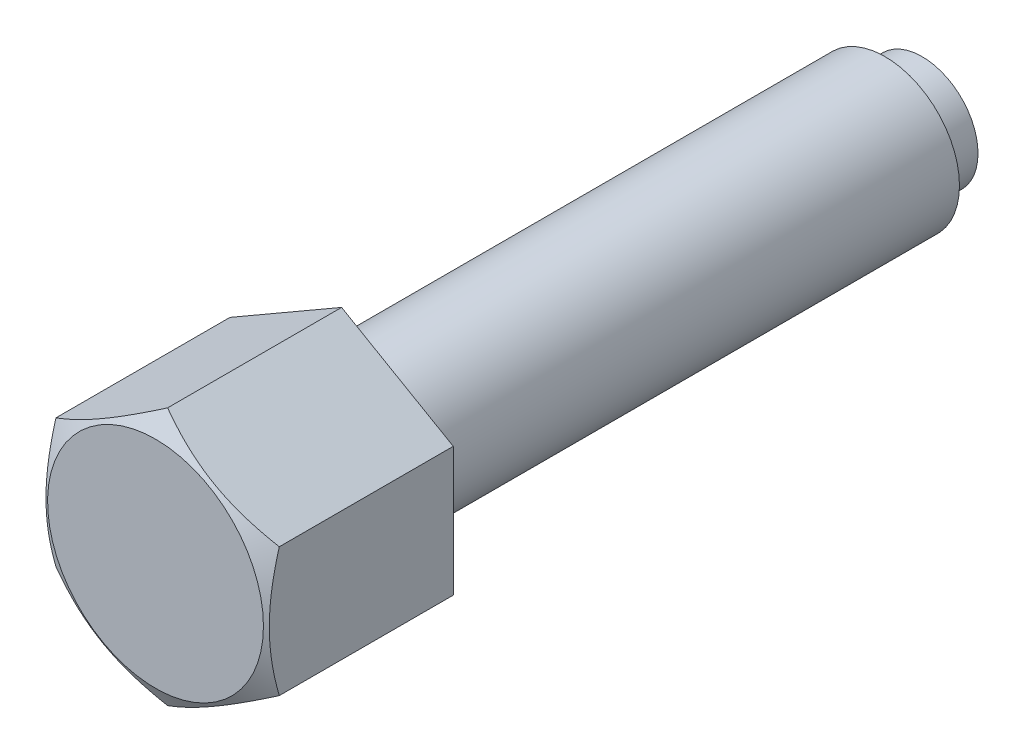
ISO-10303-21;
HEADER;
FILE_DESCRIPTION(('STEP AP214'),'2;1');
FILE_NAME('part.step','',(''),(''),'','','');
FILE_SCHEMA(('AUTOMOTIVE_DESIGN { 1 0 10303 214 1 1 1 1 }'));
ENDSEC;
DATA;
#1=APPLICATION_CONTEXT('core data for automotive mechanical design processes');
#2=APPLICATION_PROTOCOL_DEFINITION('international standard','automotive_design',2000,#1);
#3=PRODUCT_CONTEXT('',#1,'mechanical');
#4=PRODUCT('Part','Part','',(#3));
#5=PRODUCT_RELATED_PRODUCT_CATEGORY('part','',(#4));
#6=PRODUCT_DEFINITION_FORMATION('','',#4);
#7=PRODUCT_DEFINITION_CONTEXT('part definition',#1,'design');
#8=PRODUCT_DEFINITION('design','',#6,#7);
#9=PRODUCT_DEFINITION_SHAPE('','',#8);
#10=(LENGTH_UNIT() NAMED_UNIT(*) SI_UNIT(.MILLI.,.METRE.));
#11=(NAMED_UNIT(*) PLANE_ANGLE_UNIT() SI_UNIT($,.RADIAN.));
#12=(NAMED_UNIT(*) SI_UNIT($,.STERADIAN.) SOLID_ANGLE_UNIT());
#13=UNCERTAINTY_MEASURE_WITH_UNIT(LENGTH_MEASURE(1.E-05),#10,'distance_accuracy_value','');
#14=(GEOMETRIC_REPRESENTATION_CONTEXT(3) GLOBAL_UNCERTAINTY_ASSIGNED_CONTEXT((#13)) GLOBAL_UNIT_ASSIGNED_CONTEXT((#10,
#11,#12)) REPRESENTATION_CONTEXT('',''));
#15=CARTESIAN_POINT('',(0.,0.,0.));
#16=DIRECTION('',(0.,0.,1.));
#17=DIRECTION('',(1.,0.,0.));
#18=AXIS2_PLACEMENT_3D('',#15,#16,#17);
#19=CARTESIAN_POINT('',(0.,17.3205080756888,75.));
#20=DIRECTION('',(-0.5,-0.86602540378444,0.));
#21=DIRECTION('',(0.86602540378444,-0.5,0.));
#22=AXIS2_PLACEMENT_3D('',#19,#20,#21);
#23=PLANE('',#22);
#24=CARTESIAN_POINT('',(15.0002,8.66013856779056,103.371512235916));
#25=CARTESIAN_POINT('',(14.6705058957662,8.85048754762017,103.481403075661));
#26=CARTESIAN_POINT('',(14.3395258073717,9.04157899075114,103.586307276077));
#27=CARTESIAN_POINT('',(13.674911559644,9.425294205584,103.784756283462));
#28=CARTESIAN_POINT('',(13.3412765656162,9.61791845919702,103.878297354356));
#29=CARTESIAN_POINT('',(12.6707077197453,10.0050715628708,104.052762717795));
#30=CARTESIAN_POINT('',(12.333767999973,10.199603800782,104.133657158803));
#31=CARTESIAN_POINT('',(11.6575472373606,10.5900200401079,104.281092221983));
#32=CARTESIAN_POINT('',(11.3182663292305,10.7859039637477,104.347633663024));
#33=CARTESIAN_POINT('',(10.6460568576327,11.1740042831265,104.463532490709));
#34=CARTESIAN_POINT('',(10.3131781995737,11.3661918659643,104.513273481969));
#35=CARTESIAN_POINT('',(9.64589556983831,11.7514476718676,104.596678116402));
#36=CARTESIAN_POINT('',(9.31149156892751,11.9445159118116,104.630341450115));
#37=CARTESIAN_POINT('',(8.64212181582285,12.3309767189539,104.680740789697));
#38=CARTESIAN_POINT('',(8.30715720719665,12.5243686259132,104.697496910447));
#39=CARTESIAN_POINT('',(7.636918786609,12.9113309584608,104.713721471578));
#40=CARTESIAN_POINT('',(7.30164498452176,13.1049013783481,104.713190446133));
#41=CARTESIAN_POINT('',(6.67485311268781,13.4667798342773,104.696048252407));
#42=CARTESIAN_POINT('',(6.38329037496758,13.6351136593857,104.681528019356));
#43=CARTESIAN_POINT('',(5.80083556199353,13.9713941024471,104.639687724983));
#44=CARTESIAN_POINT('',(5.50994353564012,14.1393406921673,104.612366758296));
#45=CARTESIAN_POINT('',(4.92898814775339,14.4747554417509,104.545401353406));
#46=CARTESIAN_POINT('',(4.63892567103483,14.6422230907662,104.505746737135));
#47=CARTESIAN_POINT('',(4.06016058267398,14.9763732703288,104.414809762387));
#48=CARTESIAN_POINT('',(3.77145806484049,15.1430557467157,104.363526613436));
#49=CARTESIAN_POINT('',(2.89508556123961,15.6490296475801,104.190938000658));
#50=CARTESIAN_POINT('',(2.30995340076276,15.9868558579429,104.052423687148));
#51=CARTESIAN_POINT('',(1.14841408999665,16.657470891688,103.73805289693));
#52=CARTESIAN_POINT('',(0.571992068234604,16.9902683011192,103.562270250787));
#53=CARTESIAN_POINT('',(-0.000199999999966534,17.3206235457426,103.371512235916));
#54=B_SPLINE_CURVE_WITH_KNOTS('',3,(#24,#25,#26,#27,#28,#29,#30,#31,#32,#33,#34,#35,#36,#37,#38,
#39,#40,#41,#42,#43,#44,#45,#46,#47,#48,#49,#50,#51,#52,#53),.UNSPECIFIED.,.F.,.F.,(4,2,2,2,2,2,
2,2,2,2,2,2,2,2,4),(0.,1.18875411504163,2.37789802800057,3.56980778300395,4.76164951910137,
5.92407379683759,7.08652044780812,8.24758247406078,9.40860862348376,10.4193068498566,
11.4300765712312,12.4416826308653,13.4533574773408,15.5211962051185,17.5849760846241),.UNSPECIFIED.);
#55=CARTESIAN_POINT('',(15.,8.66025403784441,103.37157890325));
#56=VERTEX_POINT('',#55);
#57=CARTESIAN_POINT('',(0.,17.3205080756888,103.37157890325));
#58=VERTEX_POINT('',#57);
#59=EDGE_CURVE('E30',#56,#58,#54,.T.);
#60=ORIENTED_EDGE('',*,*,#59,.F.);
#61=DIRECTION('',(0.,0.,1.));
#62=VECTOR('',#61,1.);
#63=CARTESIAN_POINT('',(15.,8.66025403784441,75.));
#64=LINE('',#63,#62);
#65=CARTESIAN_POINT('',(15.,8.66025403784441,80.));
#66=VERTEX_POINT('',#65);
#67=EDGE_CURVE('E97',#66,#56,#64,.T.);
#68=ORIENTED_EDGE('',*,*,#67,.F.);
#69=DIRECTION('',(0.86602540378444,-0.5,0.));
#70=VECTOR('',#69,1.);
#71=CARTESIAN_POINT('',(15.,8.66025403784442,80.));
#72=LINE('',#71,#70);
#73=CARTESIAN_POINT('',(0.,17.3205080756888,80.));
#74=VERTEX_POINT('',#73);
#75=EDGE_CURVE('E111',#74,#66,#72,.T.);
#76=ORIENTED_EDGE('',*,*,#75,.F.);
#77=DIRECTION('',(0.,0.,1.));
#78=VECTOR('',#77,1.);
#79=CARTESIAN_POINT('',(0.,17.3205080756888,75.));
#80=LINE('',#79,#78);
#81=EDGE_CURVE('E37',#74,#58,#80,.T.);
#82=ORIENTED_EDGE('',*,*,#81,.T.);
#83=EDGE_LOOP('',(#60,#68,#76,#82));
#84=FACE_BOUND('',#83,.T.);
#85=ADVANCED_FACE('F15',(#84),#23,.F.);
#86=CARTESIAN_POINT('',(15.,8.66025403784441,75.));
#87=DIRECTION('',(-1.,0.,0.));
#88=DIRECTION('',(0.,-1.,0.));
#89=AXIS2_PLACEMENT_3D('',#86,#87,#88);
#90=PLANE('',#89);
#91=CARTESIAN_POINT('',(15.,-23.2748298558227,97.3849417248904));
#92=CARTESIAN_POINT('',(15.,-22.9472152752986,97.5439291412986));
#93=CARTESIAN_POINT('',(15.,-22.6192165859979,97.7021246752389));
#94=CARTESIAN_POINT('',(15.,-21.962370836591,98.0167526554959));
#95=CARTESIAN_POINT('',(15.,-21.6335237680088,98.1731850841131));
#96=CARTESIAN_POINT('',(15.,-20.645502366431,98.6396098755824));
#97=CARTESIAN_POINT('',(15.,-19.9849445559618,98.9466826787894));
#98=CARTESIAN_POINT('',(15.,-18.6558237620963,99.5528388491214));
#99=CARTESIAN_POINT('',(15.,-17.9872367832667,99.8518697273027));
#100=CARTESIAN_POINT('',(15.,-16.6447501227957,100.437715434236));
#101=CARTESIAN_POINT('',(15.,-15.9708506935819,100.724530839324));
#102=CARTESIAN_POINT('',(15.,-14.5948682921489,101.291698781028));
#103=CARTESIAN_POINT('',(15.,-13.8925761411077,101.571546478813));
#104=CARTESIAN_POINT('',(15.,-12.4797750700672,102.11009281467));
#105=CARTESIAN_POINT('',(15.,-11.7692652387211,102.368789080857));
#106=CARTESIAN_POINT('',(15.,-10.3402474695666,102.858246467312));
#107=CARTESIAN_POINT('',(15.,-9.62175902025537,103.089064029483));
#108=CARTESIAN_POINT('',(15.,-8.17440761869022,103.515378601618));
#109=CARTESIAN_POINT('',(15.,-7.44554800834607,103.710886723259));
#110=CARTESIAN_POINT('',(15.,-6.3463677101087,103.970063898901));
#111=CARTESIAN_POINT('',(15.,-5.9800004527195,104.050601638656));
#112=CARTESIAN_POINT('',(15.,-5.24476026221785,104.199356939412));
#113=CARTESIAN_POINT('',(15.,-4.87588738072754,104.26757475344));
#114=CARTESIAN_POINT('',(15.,-4.13588843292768,104.390486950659));
#115=CARTESIAN_POINT('',(15.,-3.7647623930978,104.445181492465));
#116=CARTESIAN_POINT('',(15.,-3.02065200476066,104.539956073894));
#117=CARTESIAN_POINT('',(15.,-2.64766773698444,104.580036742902));
#118=CARTESIAN_POINT('',(15.,-1.90523529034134,104.644284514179));
#119=CARTESIAN_POINT('',(15.,-1.53580462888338,104.668652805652));
#120=CARTESIAN_POINT('',(15.,-0.796244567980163,104.701744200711));
#121=CARTESIAN_POINT('',(15.,-0.426115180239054,104.710467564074));
#122=CARTESIAN_POINT('',(15.,0.314182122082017,104.712061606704));
#123=CARTESIAN_POINT('',(15.,0.684350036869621,104.704932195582));
#124=CARTESIAN_POINT('',(15.,1.42405527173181,104.674994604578));
#125=CARTESIAN_POINT('',(15.,1.79359256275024,104.652185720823));
#126=CARTESIAN_POINT('',(15.,2.68131881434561,104.579043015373));
#127=CARTESIAN_POINT('',(15.,3.19890736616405,104.521291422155));
#128=CARTESIAN_POINT('',(15.,4.23025442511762,104.378170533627));
#129=CARTESIAN_POINT('',(15.,4.74401240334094,104.292797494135));
#130=CARTESIAN_POINT('',(15.,5.76720422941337,104.097470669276));
#131=CARTESIAN_POINT('',(15.,6.27663439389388,103.987497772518));
#132=CARTESIAN_POINT('',(15.,7.29039006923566,103.74632765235));
#133=CARTESIAN_POINT('',(15.,7.79471565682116,103.615130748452));
#134=CARTESIAN_POINT('',(15.,8.80938436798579,103.331596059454));
#135=CARTESIAN_POINT('',(15.,9.31961402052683,103.178855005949));
#136=CARTESIAN_POINT('',(15.,10.3350469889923,102.857575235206));
#137=CARTESIAN_POINT('',(15.,10.8402502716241,102.689036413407));
#138=CARTESIAN_POINT('',(15.,11.8458801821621,102.338838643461));
#139=CARTESIAN_POINT('',(15.,12.3463083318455,102.157184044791));
#140=CARTESIAN_POINT('',(15.,13.3430165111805,101.78289348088));
#141=CARTESIAN_POINT('',(15.,13.8392965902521,101.590257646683));
#142=CARTESIAN_POINT('',(15.,15.0138408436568,101.121772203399));
#143=CARTESIAN_POINT('',(15.,15.6904722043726,100.841835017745));
#144=CARTESIAN_POINT('',(15.,17.0379539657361,100.268337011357));
#145=CARTESIAN_POINT('',(15.,17.7088040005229,99.9747753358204));
#146=CARTESIAN_POINT('',(15.,19.0458062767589,99.376769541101));
#147=CARTESIAN_POINT('',(15.,19.7119574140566,99.0723229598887));
#148=CARTESIAN_POINT('',(15.,21.0401980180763,98.4547538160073));
#149=CARTESIAN_POINT('',(15.,21.7022875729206,98.141631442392));
#150=CARTESIAN_POINT('',(15.,23.0238139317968,97.5079892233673));
#151=CARTESIAN_POINT('',(15.,23.6832469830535,97.1874615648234));
#152=CARTESIAN_POINT('',(15.,24.9992654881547,96.5406137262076));
#153=CARTESIAN_POINT('',(15.,25.6558509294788,96.2142935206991));
#154=CARTESIAN_POINT('',(15.,26.9665277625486,95.5569005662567));
#155=CARTESIAN_POINT('',(15.,27.6206194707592,95.2258284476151));
#156=CARTESIAN_POINT('',(15.,28.9267566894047,94.559670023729));
#157=CARTESIAN_POINT('',(15.,29.5788021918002,94.2245837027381));
#158=CARTESIAN_POINT('',(15.,31.4223565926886,93.2711426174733));
#159=CARTESIAN_POINT('',(15.,32.611815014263,92.6488231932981));
#160=CARTESIAN_POINT('',(15.,34.9863231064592,91.3957465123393));
#161=CARTESIAN_POINT('',(15.,36.1713726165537,90.7649889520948));
#162=CARTESIAN_POINT('',(15.,38.5350381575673,89.4986113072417));
#163=CARTESIAN_POINT('',(15.,39.7136628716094,88.8630074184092));
#164=CARTESIAN_POINT('',(15.,41.4795223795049,87.9058509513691));
#165=CARTESIAN_POINT('',(15.,42.0677799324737,87.5861824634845));
#166=CARTESIAN_POINT('',(15.,43.2436811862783,86.9457204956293));
#167=CARTESIAN_POINT('',(15.,43.8313248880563,86.6249270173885));
#168=CARTESIAN_POINT('',(15.,44.4186965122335,86.3036359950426));
#169=B_SPLINE_CURVE_WITH_KNOTS('',3,(#91,#92,#93,#94,#95,#96,#97,#98,#99,#100,#101,#102,#103,
#104,#105,#106,#107,#108,#109,#110,#111,#112,#113,#114,#115,#116,#117,#118,#119,#120,#121,#122,
#123,#124,#125,#126,#127,#128,#129,#130,#131,#132,#133,#134,#135,#136,#137,#138,#139,#140,#141,
#142,#143,#144,#145,#146,#147,#148,#149,#150,#151,#152,#153,#154,#155,#156,#157,#158,#159,#160,
#161,#162,#163,#164,#165,#166,#167,#168),.UNSPECIFIED.,.F.,.F.,(4,2,2,2,2,2,2,2,2,2,2,2,2,2,2,2,
2,2,2,2,2,2,2,2,2,2,2,2,2,2,2,2,2,2,2,2,2,2,4),(0.,1.09246074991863,2.18493245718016,
4.37019853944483,6.56734070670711,8.76437909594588,11.03210507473,13.3000850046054,
15.5633934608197,17.825988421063,18.951159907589,20.0763082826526,21.201443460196,
22.326530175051,23.4369085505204,24.5472684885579,25.6576347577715,26.768050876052,
28.3295886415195,29.8913381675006,31.4543052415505,33.0172487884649,34.614746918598,
36.2122556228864,37.8092369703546,39.4061992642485,41.6027558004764,43.7994503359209,
45.9966449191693,48.193791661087,50.3933732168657,52.5929644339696,54.7922665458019,
56.9915772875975,61.0187874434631,65.0461428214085,69.0633810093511,71.0718905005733,
73.0803969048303),.UNSPECIFIED.);
#170=CARTESIAN_POINT('',(15.,-8.66025403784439,103.37157890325));
#171=VERTEX_POINT('',#170);
#172=EDGE_CURVE('E157',#171,#56,#169,.T.);
#173=ORIENTED_EDGE('',*,*,#172,.F.);
#174=DIRECTION('',(0.,0.,1.));
#175=VECTOR('',#174,1.);
#176=CARTESIAN_POINT('',(15.,-8.66025403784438,75.));
#177=LINE('',#176,#175);
#178=CARTESIAN_POINT('',(15.,-8.66025403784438,80.));
#179=VERTEX_POINT('',#178);
#180=EDGE_CURVE('E94',#179,#171,#177,.T.);
#181=ORIENTED_EDGE('',*,*,#180,.F.);
#182=DIRECTION('',(0.,-1.,0.));
#183=VECTOR('',#182,1.);
#184=CARTESIAN_POINT('',(15.,0.,80.));
#185=LINE('',#184,#183);
#186=EDGE_CURVE('E108',#66,#179,#185,.T.);
#187=ORIENTED_EDGE('',*,*,#186,.F.);
#188=ORIENTED_EDGE('',*,*,#67,.T.);
#189=EDGE_LOOP('',(#173,#181,#187,#188));
#190=FACE_BOUND('',#189,.T.);
#191=ADVANCED_FACE('F137',(#190),#90,.F.);
#192=CARTESIAN_POINT('',(0.,-17.3205080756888,75.));
#193=DIRECTION('',(0.5,-0.866025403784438,0.));
#194=DIRECTION('',(0.866025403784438,0.5,0.));
#195=AXIS2_PLACEMENT_3D('',#192,#193,#194);
#196=PLANE('',#195);
#197=ORIENTED_EDGE('',*,*,#180,.T.);
#198=CARTESIAN_POINT('',(15.0002,-8.66013856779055,103.371512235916));
#199=CARTESIAN_POINT('',(14.6705058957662,-8.85048754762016,103.481403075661));
#200=CARTESIAN_POINT('',(14.3395258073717,-9.04157899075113,103.586307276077));
#201=CARTESIAN_POINT('',(13.674911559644,-9.42529420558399,103.784756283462));
#202=CARTESIAN_POINT('',(13.3412765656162,-9.61791845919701,103.878297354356));
#203=CARTESIAN_POINT('',(12.6707077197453,-10.0050715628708,104.052762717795));
#204=CARTESIAN_POINT('',(12.333767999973,-10.199603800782,104.133657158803));
#205=CARTESIAN_POINT('',(11.6575472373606,-10.5900200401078,104.281092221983));
#206=CARTESIAN_POINT('',(11.3182663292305,-10.7859039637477,104.347633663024));
#207=CARTESIAN_POINT('',(10.6460568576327,-11.1740042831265,104.463532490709));
#208=CARTESIAN_POINT('',(10.3131781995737,-11.3661918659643,104.513273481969));
#209=CARTESIAN_POINT('',(9.64589556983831,-11.7514476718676,104.596678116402));
#210=CARTESIAN_POINT('',(9.31149156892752,-11.9445159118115,104.630341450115));
#211=CARTESIAN_POINT('',(8.64212181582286,-12.3309767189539,104.680740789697));
#212=CARTESIAN_POINT('',(8.30715720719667,-12.5243686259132,104.697496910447));
#213=CARTESIAN_POINT('',(7.63691878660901,-12.9113309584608,104.713721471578));
#214=CARTESIAN_POINT('',(7.30164498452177,-13.104901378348,104.713190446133));
#215=CARTESIAN_POINT('',(6.67485311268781,-13.4667798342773,104.696048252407));
#216=CARTESIAN_POINT('',(6.38329037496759,-13.6351136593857,104.681528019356));
#217=CARTESIAN_POINT('',(5.80083556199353,-13.9713941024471,104.639687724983));
#218=CARTESIAN_POINT('',(5.50994353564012,-14.1393406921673,104.612366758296));
#219=CARTESIAN_POINT('',(4.92898814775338,-14.4747554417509,104.545401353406));
#220=CARTESIAN_POINT('',(4.63892567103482,-14.6422230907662,104.505746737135));
#221=CARTESIAN_POINT('',(4.06016058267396,-14.9763732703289,104.414809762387));
#222=CARTESIAN_POINT('',(3.77145806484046,-15.1430557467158,104.363526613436));
#223=CARTESIAN_POINT('',(2.89508556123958,-15.6490296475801,104.190938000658));
#224=CARTESIAN_POINT('',(2.30995340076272,-15.9868558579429,104.052423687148));
#225=CARTESIAN_POINT('',(1.1484140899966,-16.6574708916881,103.73805289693));
#226=CARTESIAN_POINT('',(0.571992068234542,-16.9902683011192,103.562270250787));
#227=CARTESIAN_POINT('',(-0.000200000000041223,-17.3206235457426,103.371512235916));
#228=B_SPLINE_CURVE_WITH_KNOTS('',3,(#198,#199,#200,#201,#202,#203,#204,#205,#206,#207,#208,
#209,#210,#211,#212,#213,#214,#215,#216,#217,#218,#219,#220,#221,#222,#223,#224,#225,#226,#227),
.UNSPECIFIED.,.F.,.F.,(4,2,2,2,2,2,2,2,2,2,2,2,2,2,4),(0.,1.18875411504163,2.37789802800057,
3.56980778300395,4.76164951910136,5.92407379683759,7.08652044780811,8.24758247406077,
9.40860862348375,10.4193068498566,11.4300765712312,12.4416826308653,13.4533574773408,
15.5211962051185,17.5849760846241),.UNSPECIFIED.);
#229=CARTESIAN_POINT('',(0.,-17.3205080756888,103.37157890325));
#230=VERTEX_POINT('',#229);
#231=EDGE_CURVE('E163',#171,#230,#228,.T.);
#232=ORIENTED_EDGE('',*,*,#231,.T.);
#233=DIRECTION('',(0.,0.,1.));
#234=VECTOR('',#233,1.);
#235=CARTESIAN_POINT('',(0.,-17.3205080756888,75.));
#236=LINE('',#235,#234);
#237=CARTESIAN_POINT('',(0.,-17.3205080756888,80.));
#238=VERTEX_POINT('',#237);
#239=EDGE_CURVE('E87',#238,#230,#236,.T.);
#240=ORIENTED_EDGE('',*,*,#239,.F.);
#241=DIRECTION('',(0.866025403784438,0.5,0.));
#242=VECTOR('',#241,1.);
#243=CARTESIAN_POINT('',(15.,-8.66025403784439,80.));
#244=LINE('',#243,#242);
#245=EDGE_CURVE('E106',#238,#179,#244,.T.);
#246=ORIENTED_EDGE('',*,*,#245,.T.);
#247=EDGE_LOOP('',(#197,#232,#240,#246));
#248=FACE_BOUND('',#247,.T.);
#249=ADVANCED_FACE('F143',(#248),#196,.T.);
#250=CARTESIAN_POINT('',(0.,-17.3205080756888,75.));
#251=DIRECTION('',(0.5,0.866025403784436,0.));
#252=DIRECTION('',(-0.866025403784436,0.5,0.));
#253=AXIS2_PLACEMENT_3D('',#250,#251,#252);
#254=PLANE('',#253);
#255=CARTESIAN_POINT('',(-15.0002,-8.66013856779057,103.371512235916));
#256=CARTESIAN_POINT('',(-14.6705058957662,-8.85048754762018,103.481403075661));
#257=CARTESIAN_POINT('',(-14.3395258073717,-9.04157899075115,103.586307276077));
#258=CARTESIAN_POINT('',(-13.674911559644,-9.42529420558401,103.784756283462));
#259=CARTESIAN_POINT('',(-13.3412765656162,-9.61791845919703,103.878297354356));
#260=CARTESIAN_POINT('',(-12.6707077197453,-10.0050715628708,104.052762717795));
#261=CARTESIAN_POINT('',(-12.333767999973,-10.199603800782,104.133657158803));
#262=CARTESIAN_POINT('',(-11.6575472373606,-10.5900200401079,104.281092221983));
#263=CARTESIAN_POINT('',(-11.3182663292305,-10.7859039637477,104.347633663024));
#264=CARTESIAN_POINT('',(-10.6460568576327,-11.1740042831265,104.463532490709));
#265=CARTESIAN_POINT('',(-10.3131781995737,-11.3661918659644,104.513273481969));
#266=CARTESIAN_POINT('',(-9.64589556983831,-11.7514476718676,104.596678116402));
#267=CARTESIAN_POINT('',(-9.31149156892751,-11.9445159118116,104.630341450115));
#268=CARTESIAN_POINT('',(-8.64212181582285,-12.3309767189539,104.680740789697));
#269=CARTESIAN_POINT('',(-8.30715720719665,-12.5243686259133,104.697496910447));
#270=CARTESIAN_POINT('',(-7.636918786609,-12.9113309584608,104.713721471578));
#271=CARTESIAN_POINT('',(-7.30164498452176,-13.1049013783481,104.713190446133));
#272=CARTESIAN_POINT('',(-6.67485311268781,-13.4667798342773,104.696048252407));
#273=CARTESIAN_POINT('',(-6.38329037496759,-13.6351136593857,104.681528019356));
#274=CARTESIAN_POINT('',(-5.80083556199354,-13.9713941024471,104.639687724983));
#275=CARTESIAN_POINT('',(-5.50994353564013,-14.1393406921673,104.612366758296));
#276=CARTESIAN_POINT('',(-4.9289881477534,-14.4747554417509,104.545401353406));
#277=CARTESIAN_POINT('',(-4.63892567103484,-14.6422230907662,104.505746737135));
#278=CARTESIAN_POINT('',(-4.06016058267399,-14.9763732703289,104.414809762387));
#279=CARTESIAN_POINT('',(-3.77145806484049,-15.1430557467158,104.363526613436));
#280=CARTESIAN_POINT('',(-2.89508556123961,-15.6490296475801,104.190938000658));
#281=CARTESIAN_POINT('',(-2.30995340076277,-15.9868558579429,104.052423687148));
#282=CARTESIAN_POINT('',(-1.14841408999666,-16.6574708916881,103.73805289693));
#283=CARTESIAN_POINT('',(-0.571992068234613,-16.9902683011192,103.562270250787));
#284=CARTESIAN_POINT('',(0.000199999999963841,-17.3206235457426,103.371512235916));
#285=B_SPLINE_CURVE_WITH_KNOTS('',3,(#255,#256,#257,#258,#259,#260,#261,#262,#263,#264,#265,
#266,#267,#268,#269,#270,#271,#272,#273,#274,#275,#276,#277,#278,#279,#280,#281,#282,#283,#284),
.UNSPECIFIED.,.F.,.F.,(4,2,2,2,2,2,2,2,2,2,2,2,2,2,4),(0.,1.18875411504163,2.37789802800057,
3.56980778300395,4.76164951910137,5.92407379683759,7.08652044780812,8.24758247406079,
9.40860862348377,10.4193068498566,11.4300765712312,12.4416826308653,13.4533574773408,
15.5211962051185,17.5849760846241),.UNSPECIFIED.);
#286=CARTESIAN_POINT('',(-15.,-8.66025403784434,103.37157890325));
#287=VERTEX_POINT('',#286);
#288=EDGE_CURVE('E81',#287,#230,#285,.T.);
#289=ORIENTED_EDGE('',*,*,#288,.F.);
#290=DIRECTION('',(0.,0.,1.));
#291=VECTOR('',#290,1.);
#292=CARTESIAN_POINT('',(-15.,-8.66025403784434,75.));
#293=LINE('',#292,#291);
#294=CARTESIAN_POINT('',(-15.,-8.66025403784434,80.));
#295=VERTEX_POINT('',#294);
#296=EDGE_CURVE('E80',#295,#287,#293,.T.);
#297=ORIENTED_EDGE('',*,*,#296,.F.);
#298=DIRECTION('',(-0.866025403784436,0.5,0.));
#299=VECTOR('',#298,1.);
#300=CARTESIAN_POINT('',(-1.14491749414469E-13,-17.3205080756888,80.));
#301=LINE('',#300,#299);
#302=EDGE_CURVE('E103',#238,#295,#301,.T.);
#303=ORIENTED_EDGE('',*,*,#302,.F.);
#304=ORIENTED_EDGE('',*,*,#239,.T.);
#305=EDGE_LOOP('',(#289,#297,#303,#304));
#306=FACE_BOUND('',#305,.T.);
#307=ADVANCED_FACE('F239',(#306),#254,.F.);
#308=CARTESIAN_POINT('',(-15.,8.66025403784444,75.));
#309=DIRECTION('',(-1.,0.,0.));
#310=DIRECTION('',(0.,0.,1.));
#311=AXIS2_PLACEMENT_3D('',#308,#309,#310);
#312=PLANE('',#311);
#313=ORIENTED_EDGE('',*,*,#296,.T.);
#314=CARTESIAN_POINT('',(-15.,-23.2748298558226,97.3849417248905));
#315=CARTESIAN_POINT('',(-15.,-22.9472152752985,97.5439291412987));
#316=CARTESIAN_POINT('',(-15.,-22.6192165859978,97.7021246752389));
#317=CARTESIAN_POINT('',(-15.,-21.962370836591,98.0167526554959));
#318=CARTESIAN_POINT('',(-15.,-21.6335237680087,98.1731850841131));
#319=CARTESIAN_POINT('',(-15.,-20.6455023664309,98.6396098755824));
#320=CARTESIAN_POINT('',(-15.,-19.9849445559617,98.9466826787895));
#321=CARTESIAN_POINT('',(-15.,-18.6558237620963,99.5528388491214));
#322=CARTESIAN_POINT('',(-15.,-17.9872367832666,99.8518697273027));
#323=CARTESIAN_POINT('',(-15.,-16.6447501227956,100.437715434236));
#324=CARTESIAN_POINT('',(-15.,-15.9708506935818,100.724530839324));
#325=CARTESIAN_POINT('',(-15.,-14.5948682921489,101.291698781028));
#326=CARTESIAN_POINT('',(-15.,-13.8925761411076,101.571546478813));
#327=CARTESIAN_POINT('',(-15.,-12.4797750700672,102.11009281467));
#328=CARTESIAN_POINT('',(-15.,-11.7692652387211,102.368789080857));
#329=CARTESIAN_POINT('',(-15.,-10.3402474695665,102.858246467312));
#330=CARTESIAN_POINT('',(-15.,-9.62175902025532,103.089064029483));
#331=CARTESIAN_POINT('',(-15.,-8.17440761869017,103.515378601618));
#332=CARTESIAN_POINT('',(-15.,-7.44554800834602,103.710886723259));
#333=CARTESIAN_POINT('',(-15.,-6.34636771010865,103.970063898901));
#334=CARTESIAN_POINT('',(-15.,-5.98000045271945,104.050601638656));
#335=CARTESIAN_POINT('',(-15.,-5.24476026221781,104.199356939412));
#336=CARTESIAN_POINT('',(-15.,-4.8758873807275,104.26757475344));
#337=CARTESIAN_POINT('',(-15.,-4.13588843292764,104.390486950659));
#338=CARTESIAN_POINT('',(-15.,-3.76476239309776,104.445181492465));
#339=CARTESIAN_POINT('',(-15.,-3.02065200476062,104.539956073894));
#340=CARTESIAN_POINT('',(-15.,-2.6476677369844,104.580036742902));
#341=CARTESIAN_POINT('',(-15.,-1.9052352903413,104.644284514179));
#342=CARTESIAN_POINT('',(-15.,-1.53580462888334,104.668652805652));
#343=CARTESIAN_POINT('',(-15.,-0.796244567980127,104.701744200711));
#344=CARTESIAN_POINT('',(-15.,-0.426115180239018,104.710467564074));
#345=CARTESIAN_POINT('',(-15.,0.314182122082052,104.712061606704));
#346=CARTESIAN_POINT('',(-15.,0.684350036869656,104.704932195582));
#347=CARTESIAN_POINT('',(-15.,1.42405527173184,104.674994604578));
#348=CARTESIAN_POINT('',(-15.,1.79359256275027,104.652185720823));
#349=CARTESIAN_POINT('',(-15.,2.68131881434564,104.579043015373));
#350=CARTESIAN_POINT('',(-15.,3.19890736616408,104.521291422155));
#351=CARTESIAN_POINT('',(-15.,4.23025442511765,104.378170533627));
#352=CARTESIAN_POINT('',(-15.,4.74401240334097,104.292797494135));
#353=CARTESIAN_POINT('',(-15.,5.7672042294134,104.097470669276));
#354=CARTESIAN_POINT('',(-15.,6.27663439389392,103.987497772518));
#355=CARTESIAN_POINT('',(-15.,7.2903900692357,103.74632765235));
#356=CARTESIAN_POINT('',(-15.,7.7947156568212,103.615130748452));
#357=CARTESIAN_POINT('',(-15.,8.80938436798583,103.331596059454));
#358=CARTESIAN_POINT('',(-15.,9.31961402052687,103.178855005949));
#359=CARTESIAN_POINT('',(-15.,10.3350469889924,102.857575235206));
#360=CARTESIAN_POINT('',(-15.,10.8402502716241,102.689036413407));
#361=CARTESIAN_POINT('',(-15.,11.8458801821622,102.338838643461));
#362=CARTESIAN_POINT('',(-15.,12.3463083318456,102.157184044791));
#363=CARTESIAN_POINT('',(-15.,13.3430165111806,101.78289348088));
#364=CARTESIAN_POINT('',(-15.,13.8392965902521,101.590257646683));
#365=CARTESIAN_POINT('',(-15.,15.0138408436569,101.121772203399));
#366=CARTESIAN_POINT('',(-15.,15.6904722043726,100.841835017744));
#367=CARTESIAN_POINT('',(-15.,17.0379539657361,100.268337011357));
#368=CARTESIAN_POINT('',(-15.,17.708804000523,99.9747753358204));
#369=CARTESIAN_POINT('',(-15.,19.045806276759,99.376769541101));
#370=CARTESIAN_POINT('',(-15.,19.7119574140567,99.0723229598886));
#371=CARTESIAN_POINT('',(-15.,21.0401980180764,98.4547538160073));
#372=CARTESIAN_POINT('',(-15.,21.7022875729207,98.1416314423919));
#373=CARTESIAN_POINT('',(-15.,23.0238139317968,97.5079892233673));
#374=CARTESIAN_POINT('',(-15.,23.6832469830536,97.1874615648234));
#375=CARTESIAN_POINT('',(-15.,24.9992654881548,96.5406137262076));
#376=CARTESIAN_POINT('',(-15.,25.6558509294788,96.214293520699));
#377=CARTESIAN_POINT('',(-15.,26.9665277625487,95.5569005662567));
#378=CARTESIAN_POINT('',(-15.,27.6206194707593,95.2258284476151));
#379=CARTESIAN_POINT('',(-15.,28.9267566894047,94.559670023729));
#380=CARTESIAN_POINT('',(-15.,29.5788021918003,94.2245837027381));
#381=CARTESIAN_POINT('',(-15.,31.4223565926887,93.2711426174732));
#382=CARTESIAN_POINT('',(-15.,32.611815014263,92.6488231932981));
#383=CARTESIAN_POINT('',(-15.,34.9863231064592,91.3957465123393));
#384=CARTESIAN_POINT('',(-15.,36.1713726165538,90.7649889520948));
#385=CARTESIAN_POINT('',(-15.,38.5350381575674,89.4986113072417));
#386=CARTESIAN_POINT('',(-15.,39.7136628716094,88.8630074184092));
#387=CARTESIAN_POINT('',(-15.,41.4795223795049,87.9058509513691));
#388=CARTESIAN_POINT('',(-15.,42.0677799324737,87.5861824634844));
#389=CARTESIAN_POINT('',(-15.,43.2436811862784,86.9457204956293));
#390=CARTESIAN_POINT('',(-15.,43.8313248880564,86.6249270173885));
#391=CARTESIAN_POINT('',(-15.,44.4186965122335,86.3036359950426));
#392=B_SPLINE_CURVE_WITH_KNOTS('',3,(#314,#315,#316,#317,#318,#319,#320,#321,#322,#323,#324,
#325,#326,#327,#328,#329,#330,#331,#332,#333,#334,#335,#336,#337,#338,#339,#340,#341,#342,#343,
#344,#345,#346,#347,#348,#349,#350,#351,#352,#353,#354,#355,#356,#357,#358,#359,#360,#361,#362,
#363,#364,#365,#366,#367,#368,#369,#370,#371,#372,#373,#374,#375,#376,#377,#378,#379,#380,#381,
#382,#383,#384,#385,#386,#387,#388,#389,#390,#391),.UNSPECIFIED.,.F.,.F.,(4,2,2,2,2,2,2,2,2,2,2,
2,2,2,2,2,2,2,2,2,2,2,2,2,2,2,2,2,2,2,2,2,2,2,2,2,2,2,4),(0.,1.09246074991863,2.18493245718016,
4.37019853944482,6.56734070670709,8.76437909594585,11.03210507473,13.3000850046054,
15.5633934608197,17.825988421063,18.9511599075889,20.0763082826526,21.2014434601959,
22.3265301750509,23.4369085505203,24.5472684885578,25.6576347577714,26.7680508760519,
28.3295886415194,29.8913381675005,31.4543052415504,33.0172487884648,34.614746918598,
36.2122556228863,37.8092369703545,39.4061992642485,41.6027558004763,43.7994503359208,
45.9966449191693,48.1937916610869,50.3933732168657,52.5929644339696,54.7922665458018,
56.9915772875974,61.018787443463,65.0461428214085,69.063381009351,71.0718905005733,
73.0803969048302),.UNSPECIFIED.);
#393=CARTESIAN_POINT('',(-15.,8.66025403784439,103.37157890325));
#394=VERTEX_POINT('',#393);
#395=EDGE_CURVE('E68',#287,#394,#392,.T.);
#396=ORIENTED_EDGE('',*,*,#395,.T.);
#397=DIRECTION('',(0.,0.,1.));
#398=VECTOR('',#397,1.);
#399=CARTESIAN_POINT('',(-15.,8.66025403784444,75.));
#400=LINE('',#399,#398);
#401=CARTESIAN_POINT('',(-15.,8.66025403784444,80.));
#402=VERTEX_POINT('',#401);
#403=EDGE_CURVE('E77',#402,#394,#400,.T.);
#404=ORIENTED_EDGE('',*,*,#403,.F.);
#405=DIRECTION('',(0.,-1.,0.));
#406=VECTOR('',#405,1.);
#407=CARTESIAN_POINT('',(-15.,0.,80.));
#408=LINE('',#407,#406);
#409=EDGE_CURVE('E101',#402,#295,#408,.T.);
#410=ORIENTED_EDGE('',*,*,#409,.T.);
#411=EDGE_LOOP('',(#313,#396,#404,#410));
#412=FACE_BOUND('',#411,.T.);
#413=ADVANCED_FACE('F76',(#412),#312,.T.);
#414=CARTESIAN_POINT('',(0.,17.3205080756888,75.));
#415=DIRECTION('',(-0.5,0.866025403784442,0.));
#416=DIRECTION('',(-0.866025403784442,-0.5,0.));
#417=AXIS2_PLACEMENT_3D('',#414,#415,#416);
#418=PLANE('',#417);
#419=ORIENTED_EDGE('',*,*,#403,.T.);
#420=CARTESIAN_POINT('',(-15.0002,8.66013856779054,103.371512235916));
#421=CARTESIAN_POINT('',(-14.6705058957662,8.85048754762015,103.481403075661));
#422=CARTESIAN_POINT('',(-14.3395258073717,9.04157899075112,103.586307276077));
#423=CARTESIAN_POINT('',(-13.674911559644,9.42529420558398,103.784756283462));
#424=CARTESIAN_POINT('',(-13.3412765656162,9.617918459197,103.878297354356));
#425=CARTESIAN_POINT('',(-12.6707077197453,10.0050715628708,104.052762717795));
#426=CARTESIAN_POINT('',(-12.333767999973,10.199603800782,104.133657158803));
#427=CARTESIAN_POINT('',(-11.6575472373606,10.5900200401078,104.281092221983));
#428=CARTESIAN_POINT('',(-11.3182663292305,10.7859039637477,104.347633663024));
#429=CARTESIAN_POINT('',(-10.6460568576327,11.1740042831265,104.463532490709));
#430=CARTESIAN_POINT('',(-10.3131781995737,11.3661918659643,104.513273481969));
#431=CARTESIAN_POINT('',(-9.64589556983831,11.7514476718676,104.596678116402));
#432=CARTESIAN_POINT('',(-9.31149156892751,11.9445159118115,104.630341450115));
#433=CARTESIAN_POINT('',(-8.64212181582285,12.3309767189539,104.680740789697));
#434=CARTESIAN_POINT('',(-8.30715720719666,12.5243686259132,104.697496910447));
#435=CARTESIAN_POINT('',(-7.636918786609,12.9113309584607,104.713721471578));
#436=CARTESIAN_POINT('',(-7.30164498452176,13.104901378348,104.713190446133));
#437=CARTESIAN_POINT('',(-6.6748531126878,13.4667798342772,104.696048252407));
#438=CARTESIAN_POINT('',(-6.38329037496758,13.6351136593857,104.681528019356));
#439=CARTESIAN_POINT('',(-5.80083556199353,13.971394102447,104.639687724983));
#440=CARTESIAN_POINT('',(-5.50994353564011,14.1393406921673,104.612366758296));
#441=CARTESIAN_POINT('',(-4.92898814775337,14.4747554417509,104.545401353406));
#442=CARTESIAN_POINT('',(-4.63892567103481,14.6422230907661,104.505746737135));
#443=CARTESIAN_POINT('',(-4.06016058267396,14.9763732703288,104.414809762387));
#444=CARTESIAN_POINT('',(-3.77145806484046,15.1430557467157,104.363526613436));
#445=CARTESIAN_POINT('',(-2.89508556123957,15.6490296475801,104.190938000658));
#446=CARTESIAN_POINT('',(-2.30995340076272,15.9868558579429,104.052423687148));
#447=CARTESIAN_POINT('',(-1.1484140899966,16.657470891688,103.73805289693));
#448=CARTESIAN_POINT('',(-0.571992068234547,16.9902683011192,103.562270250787));
#449=CARTESIAN_POINT('',(0.000200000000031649,17.3206235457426,103.371512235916));
#450=B_SPLINE_CURVE_WITH_KNOTS('',3,(#420,#421,#422,#423,#424,#425,#426,#427,#428,#429,#430,
#431,#432,#433,#434,#435,#436,#437,#438,#439,#440,#441,#442,#443,#444,#445,#446,#447,#448,#449),
.UNSPECIFIED.,.F.,.F.,(4,2,2,2,2,2,2,2,2,2,2,2,2,2,4),(0.,1.18875411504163,2.37789802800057,
3.56980778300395,4.76164951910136,5.92407379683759,7.08652044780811,8.24758247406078,
9.40860862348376,10.4193068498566,11.4300765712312,12.4416826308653,13.4533574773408,
15.5211962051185,17.5849760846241),.UNSPECIFIED.);
#451=EDGE_CURVE('E65',#394,#58,#450,.T.);
#452=ORIENTED_EDGE('',*,*,#451,.T.);
#453=ORIENTED_EDGE('',*,*,#81,.F.);
#454=DIRECTION('',(-0.866025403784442,-0.5,0.));
#455=VECTOR('',#454,1.);
#456=CARTESIAN_POINT('',(1.196959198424E-13,17.3205080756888,80.));
#457=LINE('',#456,#455);
#458=EDGE_CURVE('E85',#74,#402,#457,.T.);
#459=ORIENTED_EDGE('',*,*,#458,.T.);
#460=EDGE_LOOP('',(#419,#452,#453,#459));
#461=FACE_BOUND('',#460,.T.);
#462=ADVANCED_FACE('F83',(#461),#418,.T.);
#463=CARTESIAN_POINT('',(0.,0.,15.));
#464=DIRECTION('',(0.,0.,1.));
#465=DIRECTION('',(1.,0.,0.));
#466=AXIS2_PLACEMENT_3D('',#463,#464,#465);
#467=SPHERICAL_SURFACE('',#466,15.);
#468=CARTESIAN_POINT('',(0.,0.,2.00961894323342));
#469=DIRECTION('',(0.,0.,1.));
#470=DIRECTION('',(1.,0.,0.));
#471=AXIS2_PLACEMENT_3D('',#468,#469,#470);
#472=CIRCLE('',#471,7.5);
#473=CARTESIAN_POINT('',(7.5,0.,2.00961894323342));
#474=VERTEX_POINT('',#473);
#475=EDGE_CURVE('E9',#474,#474,#472,.T.);
#476=ORIENTED_EDGE('',*,*,#475,.F.);
#477=EDGE_LOOP('',(#476));
#478=FACE_BOUND('',#477,.T.);
#479=ADVANCED_FACE('F17',(#478),#467,.T.);
#480=CARTESIAN_POINT('',(0.,0.,110.));
#481=DIRECTION('',(0.,0.,1.));
#482=DIRECTION('',(1.,0.,0.));
#483=AXIS2_PLACEMENT_3D('',#480,#481,#482);
#484=CYLINDRICAL_SURFACE('',#483,7.5);
#485=ORIENTED_EDGE('',*,*,#475,.T.);
#486=EDGE_LOOP('',(#485));
#487=FACE_BOUND('',#486,.T.);
#488=CARTESIAN_POINT('',(0.,0.,7.));
#489=DIRECTION('',(0.,0.,1.));
#490=DIRECTION('',(1.,0.,0.));
#491=AXIS2_PLACEMENT_3D('',#488,#489,#490);
#492=CIRCLE('',#491,7.5);
#493=CARTESIAN_POINT('',(7.5,0.,7.));
#494=VERTEX_POINT('',#493);
#495=EDGE_CURVE('E23',#494,#494,#492,.T.);
#496=ORIENTED_EDGE('',*,*,#495,.F.);
#497=EDGE_LOOP('',(#496));
#498=FACE_BOUND('',#497,.T.);
#499=ADVANCED_FACE('F124',(#487,#498),#484,.T.);
#500=CARTESIAN_POINT('',(7.5,0.,7.));
#501=DIRECTION('',(0.,0.,1.));
#502=DIRECTION('',(1.,0.,0.));
#503=AXIS2_PLACEMENT_3D('',#500,#501,#502);
#504=PLANE('',#503);
#505=CARTESIAN_POINT('',(0.,0.,7.));
#506=DIRECTION('',(0.,0.,1.));
#507=DIRECTION('',(1.,0.,0.));
#508=AXIS2_PLACEMENT_3D('',#505,#506,#507);
#509=CIRCLE('',#508,10.);
#510=CARTESIAN_POINT('',(10.,0.,7.));
#511=VERTEX_POINT('',#510);
#512=EDGE_CURVE('E117',#511,#511,#509,.T.);
#513=ORIENTED_EDGE('',*,*,#512,.F.);
#514=EDGE_LOOP('',(#513));
#515=FACE_BOUND('',#514,.T.);
#516=ORIENTED_EDGE('',*,*,#495,.T.);
#517=EDGE_LOOP('',(#516));
#518=FACE_BOUND('',#517,.T.);
#519=ADVANCED_FACE('F122',(#515,#518),#504,.F.);
#520=CARTESIAN_POINT('',(0.,0.,110.));
#521=DIRECTION('',(0.,0.,1.));
#522=DIRECTION('',(1.,0.,0.));
#523=AXIS2_PLACEMENT_3D('',#520,#521,#522);
#524=CYLINDRICAL_SURFACE('',#523,10.);
#525=CARTESIAN_POINT('',(0.,0.,80.));
#526=DIRECTION('',(0.,0.,1.));
#527=DIRECTION('',(1.,0.,0.));
#528=AXIS2_PLACEMENT_3D('',#525,#526,#527);
#529=CIRCLE('',#528,10.);
#530=CARTESIAN_POINT('',(10.,0.,80.));
#531=VERTEX_POINT('',#530);
#532=EDGE_CURVE('E114',#531,#531,#529,.T.);
#533=ORIENTED_EDGE('',*,*,#532,.F.);
#534=EDGE_LOOP('',(#533));
#535=FACE_BOUND('',#534,.T.);
#536=ORIENTED_EDGE('',*,*,#512,.T.);
#537=EDGE_LOOP('',(#536));
#538=FACE_BOUND('',#537,.T.);
#539=ADVANCED_FACE('F132',(#535,#538),#524,.T.);
#540=CARTESIAN_POINT('',(10.,0.,80.));
#541=DIRECTION('',(0.,0.,1.));
#542=DIRECTION('',(1.,0.,0.));
#543=AXIS2_PLACEMENT_3D('',#540,#541,#542);
#544=PLANE('',#543);
#545=ORIENTED_EDGE('',*,*,#458,.F.);
#546=ORIENTED_EDGE('',*,*,#75,.T.);
#547=ORIENTED_EDGE('',*,*,#186,.T.);
#548=ORIENTED_EDGE('',*,*,#245,.F.);
#549=ORIENTED_EDGE('',*,*,#302,.T.);
#550=ORIENTED_EDGE('',*,*,#409,.F.);
#551=EDGE_LOOP('',(#545,#546,#547,#548,#549,#550));
#552=FACE_BOUND('',#551,.T.);
#553=ORIENTED_EDGE('',*,*,#532,.T.);
#554=EDGE_LOOP('',(#553));
#555=FACE_BOUND('',#554,.T.);
#556=ADVANCED_FACE('F178',(#552,#555),#544,.F.);
#557=CARTESIAN_POINT('',(0.,0.,105.));
#558=DIRECTION('',(0.,0.,-1.));
#559=DIRECTION('',(-1.,0.,0.));
#560=AXIS2_PLACEMENT_3D('',#557,#558,#559);
#561=CONICAL_SURFACE('',#560,14.5,1.0471975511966);
#562=CARTESIAN_POINT('',(0.,0.,105.));
#563=DIRECTION('',(0.,0.,1.));
#564=DIRECTION('',(1.,0.,0.));
#565=AXIS2_PLACEMENT_3D('',#562,#563,#564);
#566=CIRCLE('',#565,14.5);
#567=CARTESIAN_POINT('',(14.5,0.,105.));
#568=VERTEX_POINT('',#567);
#569=EDGE_CURVE('E71',#568,#568,#566,.T.);
#570=ORIENTED_EDGE('',*,*,#569,.F.);
#571=EDGE_LOOP('',(#570));
#572=FACE_BOUND('',#571,.T.);
#573=ORIENTED_EDGE('',*,*,#59,.T.);
#574=ORIENTED_EDGE('',*,*,#451,.F.);
#575=ORIENTED_EDGE('',*,*,#395,.F.);
#576=ORIENTED_EDGE('',*,*,#288,.T.);
#577=ORIENTED_EDGE('',*,*,#231,.F.);
#578=ORIENTED_EDGE('',*,*,#172,.T.);
#579=EDGE_LOOP('',(#573,#574,#575,#576,#577,#578));
#580=FACE_BOUND('',#579,.T.);
#581=ADVANCED_FACE('F67',(#572,#580),#561,.T.);
#582=CARTESIAN_POINT('',(0.,0.,105.));
#583=DIRECTION('',(0.,0.,1.));
#584=DIRECTION('',(1.,0.,0.));
#585=AXIS2_PLACEMENT_3D('',#582,#583,#584);
#586=PLANE('',#585);
#587=ORIENTED_EDGE('',*,*,#569,.T.);
#588=EDGE_LOOP('',(#587));
#589=FACE_BOUND('',#588,.T.);
#590=ADVANCED_FACE('F174',(#589),#586,.T.);
#591=CLOSED_SHELL('',(#85,#191,#249,#307,#413,#462,#479,#499,#519,#539,#556,#581,#590));
#592=MANIFOLD_SOLID_BREP('B1',#591);
#593=ADVANCED_BREP_SHAPE_REPRESENTATION('',(#18,#592),#14);
#594=SHAPE_DEFINITION_REPRESENTATION(#9,#593);
ENDSEC;
END-ISO-10303-21;
